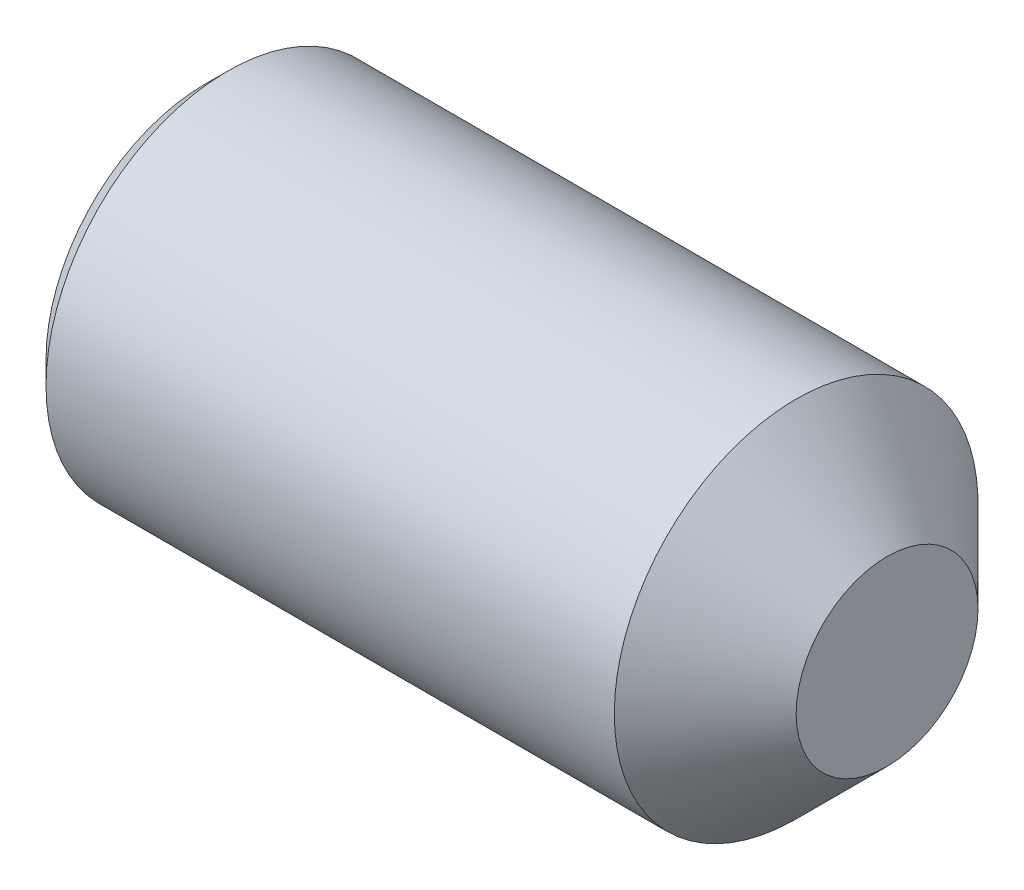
from build123d import *

# Parameters (mm, degrees)
HEXAGONSOCKET_DEPTH = 0.7


with BuildPart() as part:
    # Sketch1 → Base (revolve)
    with BuildSketch(Plane.XY, mode=Mode.PRIVATE) as base_sk:
        Polygon((0, 0), (3, 0), (3, 0.4), (2.6, 0.8), (0.1, 0.8), (0, 0.7), align=None)
    revolve(base_sk.sketch.rotate(Axis((-10.745014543, 0, 0), (1, 0, 0)), 90), axis=Axis((-10.745014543, 0, 0), (1, 0, 0)))

    # Sketch2 → HexagonSocket (cut)
    with BuildSketch(Plane(origin=(0, -0.021932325, 0.010138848), x_dir=(0, 0, 1), z_dir=(-1, 0, 0))):
        Polygon((0.39400634, 0.021932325), (0.191933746, 0.371932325), (-0.212211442, 0.371932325), (-0.414284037, 0.021932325), (-0.212211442, -0.328067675), (0.191933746, -0.328067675), align=None)
    extrude(amount=-HEXAGONSOCKET_DEPTH, mode=Mode.SUBTRACT)

    # Sketch3 → Cut-Revolve1 (revolve, cut)
    with BuildSketch(Plane.XY, mode=Mode.PRIVATE) as cut_revolve1_sk:
        Polygon((0.7, 0.35), (0.902072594, 0), (0.7, 0), align=None)
    revolve(cut_revolve1_sk.sketch.rotate(Axis((-3.144113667, 0, 0), (1, 0, 0)), 90), axis=Axis((-3.144113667, 0, 0), (1, 0, 0)), mode=Mode.SUBTRACT)


solid = part.part
